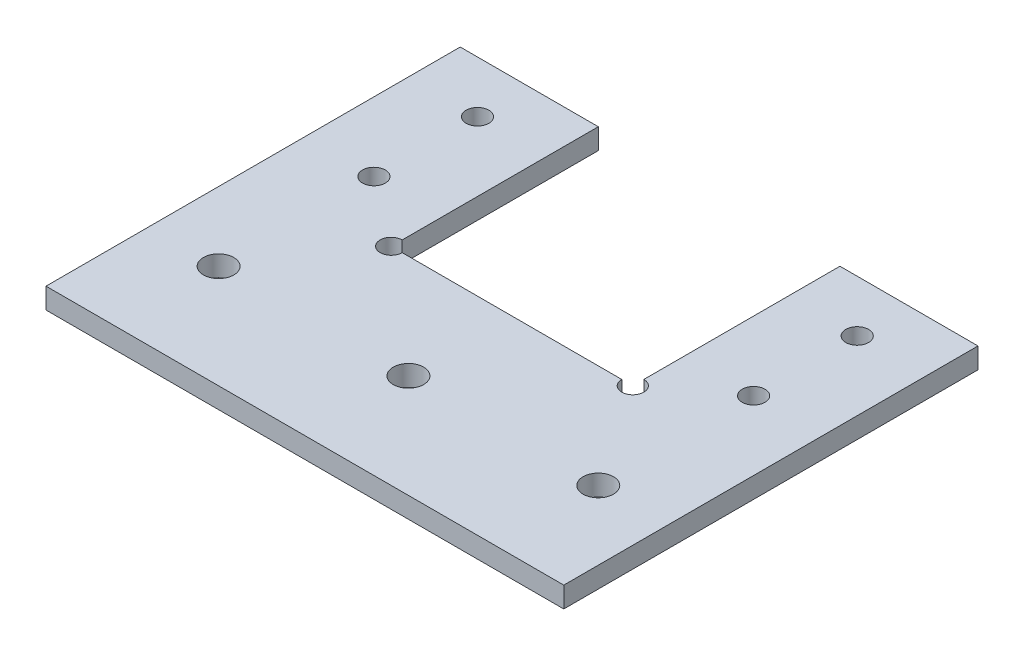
ISO-10303-21;
HEADER;
FILE_DESCRIPTION(('STEP AP214'),'2;1');
FILE_NAME('part.step','',(''),(''),'','','');
FILE_SCHEMA(('AUTOMOTIVE_DESIGN { 1 0 10303 214 1 1 1 1 }'));
ENDSEC;
DATA;
#1=APPLICATION_CONTEXT('core data for automotive mechanical design processes');
#2=APPLICATION_PROTOCOL_DEFINITION('international standard','automotive_design',2000,#1);
#3=PRODUCT_CONTEXT('',#1,'mechanical');
#4=PRODUCT('Part','Part','',(#3));
#5=PRODUCT_RELATED_PRODUCT_CATEGORY('part','',(#4));
#6=PRODUCT_DEFINITION_FORMATION('','',#4);
#7=PRODUCT_DEFINITION_CONTEXT('part definition',#1,'design');
#8=PRODUCT_DEFINITION('design','',#6,#7);
#9=PRODUCT_DEFINITION_SHAPE('','',#8);
#10=(LENGTH_UNIT() NAMED_UNIT(*) SI_UNIT(.MILLI.,.METRE.));
#11=(NAMED_UNIT(*) PLANE_ANGLE_UNIT() SI_UNIT($,.RADIAN.));
#12=(NAMED_UNIT(*) SI_UNIT($,.STERADIAN.) SOLID_ANGLE_UNIT());
#13=UNCERTAINTY_MEASURE_WITH_UNIT(LENGTH_MEASURE(1.E-05),#10,'distance_accuracy_value','');
#14=(GEOMETRIC_REPRESENTATION_CONTEXT(3) GLOBAL_UNCERTAINTY_ASSIGNED_CONTEXT((#13)) GLOBAL_UNIT_ASSIGNED_CONTEXT((#10,
#11,#12)) REPRESENTATION_CONTEXT('',''));
#15=CARTESIAN_POINT('',(0.,0.,0.));
#16=DIRECTION('',(0.,0.,1.));
#17=DIRECTION('',(1.,0.,0.));
#18=AXIS2_PLACEMENT_3D('',#15,#16,#17);
#19=CARTESIAN_POINT('',(0.,0.,0.));
#20=DIRECTION('',(0.,1.,0.));
#21=DIRECTION('',(1.,0.,0.));
#22=AXIS2_PLACEMENT_3D('',#19,#20,#21);
#23=PLANE('',#22);
#24=CARTESIAN_POINT('',(45.,0.,-22.5));
#25=DIRECTION('',(0.,1.,0.));
#26=DIRECTION('',(0.,0.,1.));
#27=AXIS2_PLACEMENT_3D('',#24,#25,#26);
#28=CIRCLE('',#27,1.65);
#29=CARTESIAN_POINT('',(45.,0.,-20.85));
#30=VERTEX_POINT('',#29);
#31=EDGE_CURVE('E178',#30,#30,#28,.T.);
#32=ORIENTED_EDGE('',*,*,#31,.T.);
#33=EDGE_LOOP('',(#32));
#34=FACE_BOUND('',#33,.T.);
#35=CARTESIAN_POINT('',(45.,0.,-7.5));
#36=DIRECTION('',(0.,1.,0.));
#37=DIRECTION('',(0.,0.,1.));
#38=AXIS2_PLACEMENT_3D('',#35,#36,#37);
#39=CIRCLE('',#38,1.65);
#40=CARTESIAN_POINT('',(45.,0.,-5.85));
#41=VERTEX_POINT('',#40);
#42=EDGE_CURVE('E182',#41,#41,#39,.T.);
#43=ORIENTED_EDGE('',*,*,#42,.T.);
#44=EDGE_LOOP('',(#43));
#45=FACE_BOUND('',#44,.T.);
#46=CARTESIAN_POINT('',(17.5,0.,15.));
#47=DIRECTION('',(0.,1.,0.));
#48=DIRECTION('',(0.,0.,1.));
#49=AXIS2_PLACEMENT_3D('',#46,#47,#48);
#50=CIRCLE('',#49,2.2);
#51=CARTESIAN_POINT('',(17.5,0.,17.2));
#52=VERTEX_POINT('',#51);
#53=EDGE_CURVE('E186',#52,#52,#50,.T.);
#54=ORIENTED_EDGE('',*,*,#53,.T.);
#55=EDGE_LOOP('',(#54));
#56=FACE_BOUND('',#55,.T.);
#57=CARTESIAN_POINT('',(-10.,0.,15.));
#58=DIRECTION('',(0.,1.,0.));
#59=DIRECTION('',(0.,0.,1.));
#60=AXIS2_PLACEMENT_3D('',#57,#58,#59);
#61=CIRCLE('',#60,2.2);
#62=CARTESIAN_POINT('',(-10.,0.,17.2));
#63=VERTEX_POINT('',#62);
#64=EDGE_CURVE('E190',#63,#63,#61,.T.);
#65=ORIENTED_EDGE('',*,*,#64,.T.);
#66=EDGE_LOOP('',(#65));
#67=FACE_BOUND('',#66,.T.);
#68=CARTESIAN_POINT('',(45.,0.,15.));
#69=DIRECTION('',(0.,1.,0.));
#70=DIRECTION('',(0.,0.,1.));
#71=AXIS2_PLACEMENT_3D('',#68,#69,#70);
#72=CIRCLE('',#71,2.2);
#73=CARTESIAN_POINT('',(45.,0.,17.2));
#74=VERTEX_POINT('',#73);
#75=EDGE_CURVE('E194',#74,#74,#72,.T.);
#76=ORIENTED_EDGE('',*,*,#75,.T.);
#77=EDGE_LOOP('',(#76));
#78=FACE_BOUND('',#77,.T.);
#79=CARTESIAN_POINT('',(-10.,0.,-7.5));
#80=DIRECTION('',(0.,1.,0.));
#81=DIRECTION('',(0.,0.,1.));
#82=AXIS2_PLACEMENT_3D('',#79,#80,#81);
#83=CIRCLE('',#82,1.65);
#84=CARTESIAN_POINT('',(-10.,0.,-5.85));
#85=VERTEX_POINT('',#84);
#86=EDGE_CURVE('E198',#85,#85,#83,.T.);
#87=ORIENTED_EDGE('',*,*,#86,.T.);
#88=EDGE_LOOP('',(#87));
#89=FACE_BOUND('',#88,.T.);
#90=CARTESIAN_POINT('',(-10.,0.,-22.5));
#91=DIRECTION('',(0.,1.,0.));
#92=DIRECTION('',(0.,0.,1.));
#93=AXIS2_PLACEMENT_3D('',#90,#91,#92);
#94=CIRCLE('',#93,1.65);
#95=CARTESIAN_POINT('',(-10.,0.,-20.85));
#96=VERTEX_POINT('',#95);
#97=EDGE_CURVE('E201',#96,#96,#94,.T.);
#98=ORIENTED_EDGE('',*,*,#97,.T.);
#99=EDGE_LOOP('',(#98));
#100=FACE_BOUND('',#99,.T.);
#101=CARTESIAN_POINT('',(0.,0.,0.));
#102=DIRECTION('',(0.,1.,0.));
#103=DIRECTION('',(0.,0.,1.));
#104=AXIS2_PLACEMENT_3D('',#101,#102,#103);
#105=CIRCLE('',#104,1.6);
#106=CARTESIAN_POINT('',(0.,0.,-1.6));
#107=VERTEX_POINT('',#106);
#108=CARTESIAN_POINT('',(1.6,0.,0.));
#109=VERTEX_POINT('',#108);
#110=EDGE_CURVE('E159',#107,#109,#105,.T.);
#111=ORIENTED_EDGE('',*,*,#110,.T.);
#112=DIRECTION('',(1.,0.,0.));
#113=VECTOR('',#112,1.);
#114=CARTESIAN_POINT('',(0.,0.,0.));
#115=LINE('',#114,#113);
#116=CARTESIAN_POINT('',(33.4,0.,0.));
#117=VERTEX_POINT('',#116);
#118=EDGE_CURVE('E26',#109,#117,#115,.T.);
#119=ORIENTED_EDGE('',*,*,#118,.T.);
#120=CARTESIAN_POINT('',(35.,0.,0.));
#121=DIRECTION('',(0.,1.,0.));
#122=DIRECTION('',(0.,0.,1.));
#123=AXIS2_PLACEMENT_3D('',#120,#121,#122);
#124=CIRCLE('',#123,1.6);
#125=CARTESIAN_POINT('',(35.,0.,-1.6));
#126=VERTEX_POINT('',#125);
#127=EDGE_CURVE('E111',#117,#126,#124,.T.);
#128=ORIENTED_EDGE('',*,*,#127,.T.);
#129=DIRECTION('',(0.,0.,-1.));
#130=VECTOR('',#129,1.);
#131=CARTESIAN_POINT('',(35.,0.,0.));
#132=LINE('',#131,#130);
#133=CARTESIAN_POINT('',(35.,0.,-30.));
#134=VERTEX_POINT('',#133);
#135=EDGE_CURVE('E141',#126,#134,#132,.T.);
#136=ORIENTED_EDGE('',*,*,#135,.T.);
#137=DIRECTION('',(1.,0.,0.));
#138=VECTOR('',#137,1.);
#139=CARTESIAN_POINT('',(0.,0.,-30.));
#140=LINE('',#139,#138);
#141=CARTESIAN_POINT('',(55.,0.,-30.));
#142=VERTEX_POINT('',#141);
#143=EDGE_CURVE('E296',#134,#142,#140,.T.);
#144=ORIENTED_EDGE('',*,*,#143,.T.);
#145=DIRECTION('',(0.,0.,1.));
#146=VECTOR('',#145,1.);
#147=CARTESIAN_POINT('',(55.,0.,0.));
#148=LINE('',#147,#146);
#149=CARTESIAN_POINT('',(55.,0.,30.));
#150=VERTEX_POINT('',#149);
#151=EDGE_CURVE('E286',#142,#150,#148,.T.);
#152=ORIENTED_EDGE('',*,*,#151,.T.);
#153=DIRECTION('',(1.,0.,0.));
#154=VECTOR('',#153,1.);
#155=CARTESIAN_POINT('',(0.,0.,30.));
#156=LINE('',#155,#154);
#157=CARTESIAN_POINT('',(-20.,0.,30.));
#158=VERTEX_POINT('',#157);
#159=EDGE_CURVE('E232',#158,#150,#156,.T.);
#160=ORIENTED_EDGE('',*,*,#159,.F.);
#161=DIRECTION('',(0.,0.,-1.));
#162=VECTOR('',#161,1.);
#163=CARTESIAN_POINT('',(-20.,0.,0.));
#164=LINE('',#163,#162);
#165=CARTESIAN_POINT('',(-20.,0.,-30.));
#166=VERTEX_POINT('',#165);
#167=EDGE_CURVE('E274',#158,#166,#164,.T.);
#168=ORIENTED_EDGE('',*,*,#167,.T.);
#169=DIRECTION('',(1.,0.,0.));
#170=VECTOR('',#169,1.);
#171=CARTESIAN_POINT('',(0.,0.,-30.));
#172=LINE('',#171,#170);
#173=CARTESIAN_POINT('',(0.,0.,-30.));
#174=VERTEX_POINT('',#173);
#175=EDGE_CURVE('E268',#166,#174,#172,.T.);
#176=ORIENTED_EDGE('',*,*,#175,.T.);
#177=DIRECTION('',(0.,0.,-1.));
#178=VECTOR('',#177,1.);
#179=CARTESIAN_POINT('',(0.,0.,0.));
#180=LINE('',#179,#178);
#181=EDGE_CURVE('E256',#107,#174,#180,.T.);
#182=ORIENTED_EDGE('',*,*,#181,.F.);
#183=EDGE_LOOP('',(#111,#119,#128,#136,#144,#152,#160,#168,#176,#182));
#184=FACE_BOUND('',#183,.T.);
#185=ADVANCED_FACE('F17',(#34,#45,#56,#67,#78,#89,#100,#184),#23,.F.);
#186=CARTESIAN_POINT('',(0.,3.,0.));
#187=DIRECTION('',(0.,1.,0.));
#188=DIRECTION('',(1.,0.,0.));
#189=AXIS2_PLACEMENT_3D('',#186,#187,#188);
#190=PLANE('',#189);
#191=CARTESIAN_POINT('',(45.,3.,-22.5));
#192=DIRECTION('',(0.,1.,0.));
#193=DIRECTION('',(0.,0.,1.));
#194=AXIS2_PLACEMENT_3D('',#191,#192,#193);
#195=CIRCLE('',#194,1.65);
#196=CARTESIAN_POINT('',(45.,3.,-20.85));
#197=VERTEX_POINT('',#196);
#198=EDGE_CURVE('E541',#197,#197,#195,.T.);
#199=ORIENTED_EDGE('',*,*,#198,.F.);
#200=EDGE_LOOP('',(#199));
#201=FACE_BOUND('',#200,.T.);
#202=CARTESIAN_POINT('',(45.,3.,-7.5));
#203=DIRECTION('',(0.,1.,0.));
#204=DIRECTION('',(0.,0.,1.));
#205=AXIS2_PLACEMENT_3D('',#202,#203,#204);
#206=CIRCLE('',#205,1.65);
#207=CARTESIAN_POINT('',(45.,3.,-5.85));
#208=VERTEX_POINT('',#207);
#209=EDGE_CURVE('E220',#208,#208,#206,.T.);
#210=ORIENTED_EDGE('',*,*,#209,.F.);
#211=EDGE_LOOP('',(#210));
#212=FACE_BOUND('',#211,.T.);
#213=CARTESIAN_POINT('',(17.5,3.,15.));
#214=DIRECTION('',(0.,1.,0.));
#215=DIRECTION('',(0.,0.,1.));
#216=AXIS2_PLACEMENT_3D('',#213,#214,#215);
#217=CIRCLE('',#216,2.2);
#218=CARTESIAN_POINT('',(17.5,3.,17.2));
#219=VERTEX_POINT('',#218);
#220=EDGE_CURVE('E221',#219,#219,#217,.T.);
#221=ORIENTED_EDGE('',*,*,#220,.F.);
#222=EDGE_LOOP('',(#221));
#223=FACE_BOUND('',#222,.T.);
#224=CARTESIAN_POINT('',(-10.,3.,15.));
#225=DIRECTION('',(0.,1.,0.));
#226=DIRECTION('',(0.,0.,1.));
#227=AXIS2_PLACEMENT_3D('',#224,#225,#226);
#228=CIRCLE('',#227,2.2);
#229=CARTESIAN_POINT('',(-10.,3.,17.2));
#230=VERTEX_POINT('',#229);
#231=EDGE_CURVE('E225',#230,#230,#228,.T.);
#232=ORIENTED_EDGE('',*,*,#231,.F.);
#233=EDGE_LOOP('',(#232));
#234=FACE_BOUND('',#233,.T.);
#235=CARTESIAN_POINT('',(45.,3.,15.));
#236=DIRECTION('',(0.,1.,0.));
#237=DIRECTION('',(0.,0.,1.));
#238=AXIS2_PLACEMENT_3D('',#235,#236,#237);
#239=CIRCLE('',#238,2.2);
#240=CARTESIAN_POINT('',(45.,3.,17.2));
#241=VERTEX_POINT('',#240);
#242=EDGE_CURVE('E224',#241,#241,#239,.T.);
#243=ORIENTED_EDGE('',*,*,#242,.F.);
#244=EDGE_LOOP('',(#243));
#245=FACE_BOUND('',#244,.T.);
#246=CARTESIAN_POINT('',(-10.,3.,-7.5));
#247=DIRECTION('',(0.,1.,0.));
#248=DIRECTION('',(0.,0.,1.));
#249=AXIS2_PLACEMENT_3D('',#246,#247,#248);
#250=CIRCLE('',#249,1.65);
#251=CARTESIAN_POINT('',(-10.,3.,-5.85));
#252=VERTEX_POINT('',#251);
#253=EDGE_CURVE('E204',#252,#252,#250,.T.);
#254=ORIENTED_EDGE('',*,*,#253,.F.);
#255=EDGE_LOOP('',(#254));
#256=FACE_BOUND('',#255,.T.);
#257=CARTESIAN_POINT('',(-10.,3.,-22.5));
#258=DIRECTION('',(0.,1.,0.));
#259=DIRECTION('',(0.,0.,1.));
#260=AXIS2_PLACEMENT_3D('',#257,#258,#259);
#261=CIRCLE('',#260,1.65);
#262=CARTESIAN_POINT('',(-10.,3.,-20.85));
#263=VERTEX_POINT('',#262);
#264=EDGE_CURVE('E205',#263,#263,#261,.T.);
#265=ORIENTED_EDGE('',*,*,#264,.F.);
#266=EDGE_LOOP('',(#265));
#267=FACE_BOUND('',#266,.T.);
#268=CARTESIAN_POINT('',(0.,3.,0.));
#269=DIRECTION('',(0.,1.,0.));
#270=DIRECTION('',(0.,0.,1.));
#271=AXIS2_PLACEMENT_3D('',#268,#269,#270);
#272=CIRCLE('',#271,1.6);
#273=CARTESIAN_POINT('',(0.,3.,-1.6));
#274=VERTEX_POINT('',#273);
#275=CARTESIAN_POINT('',(1.6,3.,0.));
#276=VERTEX_POINT('',#275);
#277=EDGE_CURVE('E249',#274,#276,#272,.T.);
#278=ORIENTED_EDGE('',*,*,#277,.F.);
#279=DIRECTION('',(0.,0.,-1.));
#280=VECTOR('',#279,1.);
#281=CARTESIAN_POINT('',(0.,3.,0.));
#282=LINE('',#281,#280);
#283=CARTESIAN_POINT('',(0.,3.,-30.));
#284=VERTEX_POINT('',#283);
#285=EDGE_CURVE('E264',#274,#284,#282,.T.);
#286=ORIENTED_EDGE('',*,*,#285,.T.);
#287=DIRECTION('',(1.,0.,0.));
#288=VECTOR('',#287,1.);
#289=CARTESIAN_POINT('',(0.,3.,-30.));
#290=LINE('',#289,#288);
#291=CARTESIAN_POINT('',(-20.,3.,-30.));
#292=VERTEX_POINT('',#291);
#293=EDGE_CURVE('E271',#292,#284,#290,.T.);
#294=ORIENTED_EDGE('',*,*,#293,.F.);
#295=DIRECTION('',(0.,0.,-1.));
#296=VECTOR('',#295,1.);
#297=CARTESIAN_POINT('',(-20.,3.,0.));
#298=LINE('',#297,#296);
#299=CARTESIAN_POINT('',(-20.,3.,30.));
#300=VERTEX_POINT('',#299);
#301=EDGE_CURVE('E236',#300,#292,#298,.T.);
#302=ORIENTED_EDGE('',*,*,#301,.F.);
#303=DIRECTION('',(1.,0.,0.));
#304=VECTOR('',#303,1.);
#305=CARTESIAN_POINT('',(0.,3.,30.));
#306=LINE('',#305,#304);
#307=CARTESIAN_POINT('',(55.,3.,30.));
#308=VERTEX_POINT('',#307);
#309=EDGE_CURVE('E282',#300,#308,#306,.T.);
#310=ORIENTED_EDGE('',*,*,#309,.T.);
#311=DIRECTION('',(0.,0.,1.));
#312=VECTOR('',#311,1.);
#313=CARTESIAN_POINT('',(55.,3.,0.));
#314=LINE('',#313,#312);
#315=CARTESIAN_POINT('',(55.,3.,-30.));
#316=VERTEX_POINT('',#315);
#317=EDGE_CURVE('E293',#316,#308,#314,.T.);
#318=ORIENTED_EDGE('',*,*,#317,.F.);
#319=DIRECTION('',(1.,0.,0.));
#320=VECTOR('',#319,1.);
#321=CARTESIAN_POINT('',(0.,3.,-30.));
#322=LINE('',#321,#320);
#323=CARTESIAN_POINT('',(35.,3.,-30.));
#324=VERTEX_POINT('',#323);
#325=EDGE_CURVE('E134',#324,#316,#322,.T.);
#326=ORIENTED_EDGE('',*,*,#325,.F.);
#327=DIRECTION('',(0.,0.,-1.));
#328=VECTOR('',#327,1.);
#329=CARTESIAN_POINT('',(35.,3.,0.));
#330=LINE('',#329,#328);
#331=CARTESIAN_POINT('',(35.,3.,-1.6));
#332=VERTEX_POINT('',#331);
#333=EDGE_CURVE('E130',#332,#324,#330,.T.);
#334=ORIENTED_EDGE('',*,*,#333,.F.);
#335=CARTESIAN_POINT('',(35.,3.,0.));
#336=DIRECTION('',(0.,1.,0.));
#337=DIRECTION('',(0.,0.,1.));
#338=AXIS2_PLACEMENT_3D('',#335,#336,#337);
#339=CIRCLE('',#338,1.6);
#340=CARTESIAN_POINT('',(33.4,3.,0.));
#341=VERTEX_POINT('',#340);
#342=EDGE_CURVE('E119',#341,#332,#339,.T.);
#343=ORIENTED_EDGE('',*,*,#342,.F.);
#344=DIRECTION('',(1.,0.,0.));
#345=VECTOR('',#344,1.);
#346=CARTESIAN_POINT('',(0.,3.,0.));
#347=LINE('',#346,#345);
#348=EDGE_CURVE('E11',#276,#341,#347,.T.);
#349=ORIENTED_EDGE('',*,*,#348,.F.);
#350=EDGE_LOOP('',(#278,#286,#294,#302,#310,#318,#326,#334,#343,#349));
#351=FACE_BOUND('',#350,.T.);
#352=ADVANCED_FACE('F132',(#201,#212,#223,#234,#245,#256,#267,#351),#190,.T.);
#353=CARTESIAN_POINT('',(0.,3.,0.));
#354=DIRECTION('',(0.,0.,-1.));
#355=DIRECTION('',(0.,-1.,0.));
#356=AXIS2_PLACEMENT_3D('',#353,#354,#355);
#357=PLANE('',#356);
#358=ORIENTED_EDGE('',*,*,#118,.F.);
#359=DIRECTION('',(0.,-1.,0.));
#360=VECTOR('',#359,1.);
#361=CARTESIAN_POINT('',(1.6,3.,0.));
#362=LINE('',#361,#360);
#363=EDGE_CURVE('E253',#276,#109,#362,.T.);
#364=ORIENTED_EDGE('',*,*,#363,.F.);
#365=ORIENTED_EDGE('',*,*,#348,.T.);
#366=DIRECTION('',(0.,-1.,0.));
#367=VECTOR('',#366,1.);
#368=CARTESIAN_POINT('',(33.4,3.,0.));
#369=LINE('',#368,#367);
#370=EDGE_CURVE('E125',#341,#117,#369,.T.);
#371=ORIENTED_EDGE('',*,*,#370,.T.);
#372=EDGE_LOOP('',(#358,#364,#365,#371));
#373=FACE_BOUND('',#372,.T.);
#374=ADVANCED_FACE('F161',(#373),#357,.T.);
#375=CARTESIAN_POINT('',(35.,3.,0.));
#376=DIRECTION('',(0.,-1.,0.));
#377=DIRECTION('',(0.,0.,-1.));
#378=AXIS2_PLACEMENT_3D('',#375,#376,#377);
#379=CYLINDRICAL_SURFACE('',#378,1.6);
#380=ORIENTED_EDGE('',*,*,#127,.F.);
#381=ORIENTED_EDGE('',*,*,#370,.F.);
#382=ORIENTED_EDGE('',*,*,#342,.T.);
#383=DIRECTION('',(0.,-1.,0.));
#384=VECTOR('',#383,1.);
#385=CARTESIAN_POINT('',(35.,3.,-1.6));
#386=LINE('',#385,#384);
#387=EDGE_CURVE('E123',#332,#126,#386,.T.);
#388=ORIENTED_EDGE('',*,*,#387,.T.);
#389=EDGE_LOOP('',(#380,#381,#382,#388));
#390=FACE_BOUND('',#389,.T.);
#391=ADVANCED_FACE('F121',(#390),#379,.F.);
#392=CARTESIAN_POINT('',(35.,3.,0.));
#393=DIRECTION('',(-1.,0.,0.));
#394=DIRECTION('',(0.,0.,1.));
#395=AXIS2_PLACEMENT_3D('',#392,#393,#394);
#396=PLANE('',#395);
#397=ORIENTED_EDGE('',*,*,#135,.F.);
#398=ORIENTED_EDGE('',*,*,#387,.F.);
#399=ORIENTED_EDGE('',*,*,#333,.T.);
#400=DIRECTION('',(0.,-1.,0.));
#401=VECTOR('',#400,1.);
#402=CARTESIAN_POINT('',(35.,3.,-30.));
#403=LINE('',#402,#401);
#404=EDGE_CURVE('E299',#324,#134,#403,.T.);
#405=ORIENTED_EDGE('',*,*,#404,.T.);
#406=EDGE_LOOP('',(#397,#398,#399,#405));
#407=FACE_BOUND('',#406,.T.);
#408=ADVANCED_FACE('F140',(#407),#396,.T.);
#409=CARTESIAN_POINT('',(0.,3.,-30.));
#410=DIRECTION('',(0.,0.,-1.));
#411=DIRECTION('',(0.,-1.,0.));
#412=AXIS2_PLACEMENT_3D('',#409,#410,#411);
#413=PLANE('',#412);
#414=ORIENTED_EDGE('',*,*,#143,.F.);
#415=ORIENTED_EDGE('',*,*,#404,.F.);
#416=ORIENTED_EDGE('',*,*,#325,.T.);
#417=DIRECTION('',(0.,-1.,0.));
#418=VECTOR('',#417,1.);
#419=CARTESIAN_POINT('',(55.,3.,-30.));
#420=LINE('',#419,#418);
#421=EDGE_CURVE('E289',#316,#142,#420,.T.);
#422=ORIENTED_EDGE('',*,*,#421,.T.);
#423=EDGE_LOOP('',(#414,#415,#416,#422));
#424=FACE_BOUND('',#423,.T.);
#425=ADVANCED_FACE('F306',(#424),#413,.T.);
#426=CARTESIAN_POINT('',(55.,3.,0.));
#427=DIRECTION('',(1.,0.,0.));
#428=DIRECTION('',(0.,1.,0.));
#429=AXIS2_PLACEMENT_3D('',#426,#427,#428);
#430=PLANE('',#429);
#431=ORIENTED_EDGE('',*,*,#151,.F.);
#432=ORIENTED_EDGE('',*,*,#421,.F.);
#433=ORIENTED_EDGE('',*,*,#317,.T.);
#434=DIRECTION('',(0.,-1.,0.));
#435=VECTOR('',#434,1.);
#436=CARTESIAN_POINT('',(55.,3.,30.));
#437=LINE('',#436,#435);
#438=EDGE_CURVE('E235',#308,#150,#437,.T.);
#439=ORIENTED_EDGE('',*,*,#438,.T.);
#440=EDGE_LOOP('',(#431,#432,#433,#439));
#441=FACE_BOUND('',#440,.T.);
#442=ADVANCED_FACE('F313',(#441),#430,.T.);
#443=CARTESIAN_POINT('',(0.,3.,30.));
#444=DIRECTION('',(0.,0.,-1.));
#445=DIRECTION('',(0.,-1.,0.));
#446=AXIS2_PLACEMENT_3D('',#443,#444,#445);
#447=PLANE('',#446);
#448=ORIENTED_EDGE('',*,*,#159,.T.);
#449=ORIENTED_EDGE('',*,*,#438,.F.);
#450=ORIENTED_EDGE('',*,*,#309,.F.);
#451=DIRECTION('',(0.,-1.,0.));
#452=VECTOR('',#451,1.);
#453=CARTESIAN_POINT('',(-20.,3.,30.));
#454=LINE('',#453,#452);
#455=EDGE_CURVE('E275',#300,#158,#454,.T.);
#456=ORIENTED_EDGE('',*,*,#455,.T.);
#457=EDGE_LOOP('',(#448,#449,#450,#456));
#458=FACE_BOUND('',#457,.T.);
#459=ADVANCED_FACE('F318',(#458),#447,.F.);
#460=CARTESIAN_POINT('',(-20.,3.,0.));
#461=DIRECTION('',(-1.,0.,0.));
#462=DIRECTION('',(0.,1.,0.));
#463=AXIS2_PLACEMENT_3D('',#460,#461,#462);
#464=PLANE('',#463);
#465=ORIENTED_EDGE('',*,*,#167,.F.);
#466=ORIENTED_EDGE('',*,*,#455,.F.);
#467=ORIENTED_EDGE('',*,*,#301,.T.);
#468=DIRECTION('',(0.,-1.,0.));
#469=VECTOR('',#468,1.);
#470=CARTESIAN_POINT('',(-20.,3.,-30.));
#471=LINE('',#470,#469);
#472=EDGE_CURVE('E216',#292,#166,#471,.T.);
#473=ORIENTED_EDGE('',*,*,#472,.T.);
#474=EDGE_LOOP('',(#465,#466,#467,#473));
#475=FACE_BOUND('',#474,.T.);
#476=ADVANCED_FACE('F320',(#475),#464,.T.);
#477=CARTESIAN_POINT('',(0.,3.,-30.));
#478=DIRECTION('',(0.,0.,-1.));
#479=DIRECTION('',(0.,-1.,0.));
#480=AXIS2_PLACEMENT_3D('',#477,#478,#479);
#481=PLANE('',#480);
#482=ORIENTED_EDGE('',*,*,#175,.F.);
#483=ORIENTED_EDGE('',*,*,#472,.F.);
#484=ORIENTED_EDGE('',*,*,#293,.T.);
#485=DIRECTION('',(0.,-1.,0.));
#486=VECTOR('',#485,1.);
#487=CARTESIAN_POINT('',(0.,3.,-30.));
#488=LINE('',#487,#486);
#489=EDGE_CURVE('E260',#284,#174,#488,.T.);
#490=ORIENTED_EDGE('',*,*,#489,.T.);
#491=EDGE_LOOP('',(#482,#483,#484,#490));
#492=FACE_BOUND('',#491,.T.);
#493=ADVANCED_FACE('F361',(#492),#481,.T.);
#494=CARTESIAN_POINT('',(0.,3.,0.));
#495=DIRECTION('',(-1.,0.,0.));
#496=DIRECTION('',(0.,0.,1.));
#497=AXIS2_PLACEMENT_3D('',#494,#495,#496);
#498=PLANE('',#497);
#499=ORIENTED_EDGE('',*,*,#181,.T.);
#500=ORIENTED_EDGE('',*,*,#489,.F.);
#501=ORIENTED_EDGE('',*,*,#285,.F.);
#502=DIRECTION('',(0.,-1.,0.));
#503=VECTOR('',#502,1.);
#504=CARTESIAN_POINT('',(0.,3.,-1.6));
#505=LINE('',#504,#503);
#506=EDGE_CURVE('E245',#274,#107,#505,.T.);
#507=ORIENTED_EDGE('',*,*,#506,.T.);
#508=EDGE_LOOP('',(#499,#500,#501,#507));
#509=FACE_BOUND('',#508,.T.);
#510=ADVANCED_FACE('F366',(#509),#498,.F.);
#511=CARTESIAN_POINT('',(0.,3.,0.));
#512=DIRECTION('',(0.,-1.,0.));
#513=DIRECTION('',(0.,0.,-1.));
#514=AXIS2_PLACEMENT_3D('',#511,#512,#513);
#515=CYLINDRICAL_SURFACE('',#514,1.6);
#516=ORIENTED_EDGE('',*,*,#110,.F.);
#517=ORIENTED_EDGE('',*,*,#506,.F.);
#518=ORIENTED_EDGE('',*,*,#277,.T.);
#519=ORIENTED_EDGE('',*,*,#363,.T.);
#520=EDGE_LOOP('',(#516,#517,#518,#519));
#521=FACE_BOUND('',#520,.T.);
#522=ADVANCED_FACE('F362',(#521),#515,.F.);
#523=CARTESIAN_POINT('',(45.,3.,-7.5));
#524=DIRECTION('',(0.,-1.,0.));
#525=DIRECTION('',(0.,0.,-1.));
#526=AXIS2_PLACEMENT_3D('',#523,#524,#525);
#527=CYLINDRICAL_SURFACE('',#526,1.65);
#528=ORIENTED_EDGE('',*,*,#42,.F.);
#529=EDGE_LOOP('',(#528));
#530=FACE_BOUND('',#529,.T.);
#531=ORIENTED_EDGE('',*,*,#209,.T.);
#532=EDGE_LOOP('',(#531));
#533=FACE_BOUND('',#532,.T.);
#534=ADVANCED_FACE('F365',(#530,#533),#527,.F.);
#535=CARTESIAN_POINT('',(17.5,3.,15.));
#536=DIRECTION('',(0.,-1.,0.));
#537=DIRECTION('',(0.,0.,-1.));
#538=AXIS2_PLACEMENT_3D('',#535,#536,#537);
#539=CYLINDRICAL_SURFACE('',#538,2.2);
#540=ORIENTED_EDGE('',*,*,#53,.F.);
#541=EDGE_LOOP('',(#540));
#542=FACE_BOUND('',#541,.T.);
#543=ORIENTED_EDGE('',*,*,#220,.T.);
#544=EDGE_LOOP('',(#543));
#545=FACE_BOUND('',#544,.T.);
#546=ADVANCED_FACE('F374',(#542,#545),#539,.F.);
#547=CARTESIAN_POINT('',(-10.,3.,15.));
#548=DIRECTION('',(0.,-1.,0.));
#549=DIRECTION('',(0.,0.,-1.));
#550=AXIS2_PLACEMENT_3D('',#547,#548,#549);
#551=CYLINDRICAL_SURFACE('',#550,2.2);
#552=ORIENTED_EDGE('',*,*,#64,.F.);
#553=EDGE_LOOP('',(#552));
#554=FACE_BOUND('',#553,.T.);
#555=ORIENTED_EDGE('',*,*,#231,.T.);
#556=EDGE_LOOP('',(#555));
#557=FACE_BOUND('',#556,.T.);
#558=ADVANCED_FACE('F370',(#554,#557),#551,.F.);
#559=CARTESIAN_POINT('',(45.,3.,15.));
#560=DIRECTION('',(0.,-1.,0.));
#561=DIRECTION('',(0.,0.,-1.));
#562=AXIS2_PLACEMENT_3D('',#559,#560,#561);
#563=CYLINDRICAL_SURFACE('',#562,2.2);
#564=ORIENTED_EDGE('',*,*,#75,.F.);
#565=EDGE_LOOP('',(#564));
#566=FACE_BOUND('',#565,.T.);
#567=ORIENTED_EDGE('',*,*,#242,.T.);
#568=EDGE_LOOP('',(#567));
#569=FACE_BOUND('',#568,.T.);
#570=ADVANCED_FACE('F338',(#566,#569),#563,.F.);
#571=CARTESIAN_POINT('',(-10.,3.,-7.5));
#572=DIRECTION('',(0.,-1.,0.));
#573=DIRECTION('',(0.,0.,-1.));
#574=AXIS2_PLACEMENT_3D('',#571,#572,#573);
#575=CYLINDRICAL_SURFACE('',#574,1.65);
#576=ORIENTED_EDGE('',*,*,#86,.F.);
#577=EDGE_LOOP('',(#576));
#578=FACE_BOUND('',#577,.T.);
#579=ORIENTED_EDGE('',*,*,#253,.T.);
#580=EDGE_LOOP('',(#579));
#581=FACE_BOUND('',#580,.T.);
#582=ADVANCED_FACE('F348',(#578,#581),#575,.F.);
#583=CARTESIAN_POINT('',(-10.,3.,-22.5));
#584=DIRECTION('',(0.,-1.,0.));
#585=DIRECTION('',(0.,0.,-1.));
#586=AXIS2_PLACEMENT_3D('',#583,#584,#585);
#587=CYLINDRICAL_SURFACE('',#586,1.65);
#588=ORIENTED_EDGE('',*,*,#97,.F.);
#589=EDGE_LOOP('',(#588));
#590=FACE_BOUND('',#589,.T.);
#591=ORIENTED_EDGE('',*,*,#264,.T.);
#592=EDGE_LOOP('',(#591));
#593=FACE_BOUND('',#592,.T.);
#594=ADVANCED_FACE('F345',(#590,#593),#587,.F.);
#595=CARTESIAN_POINT('',(45.,3.,-22.5));
#596=DIRECTION('',(0.,-1.,0.));
#597=DIRECTION('',(0.,0.,-1.));
#598=AXIS2_PLACEMENT_3D('',#595,#596,#597);
#599=CYLINDRICAL_SURFACE('',#598,1.65);
#600=ORIENTED_EDGE('',*,*,#31,.F.);
#601=EDGE_LOOP('',(#600));
#602=FACE_BOUND('',#601,.T.);
#603=ORIENTED_EDGE('',*,*,#198,.T.);
#604=EDGE_LOOP('',(#603));
#605=FACE_BOUND('',#604,.T.);
#606=ADVANCED_FACE('F347',(#602,#605),#599,.F.);
#607=CLOSED_SHELL('',(#185,#352,#374,#391,#408,#425,#442,#459,#476,#493,#510,#522,#534,#546,
#558,#570,#582,#594,#606));
#608=MANIFOLD_SOLID_BREP('B1',#607);
#609=ADVANCED_BREP_SHAPE_REPRESENTATION('',(#18,#608),#14);
#610=SHAPE_DEFINITION_REPRESENTATION(#9,#609);
ENDSEC;
END-ISO-10303-21;
